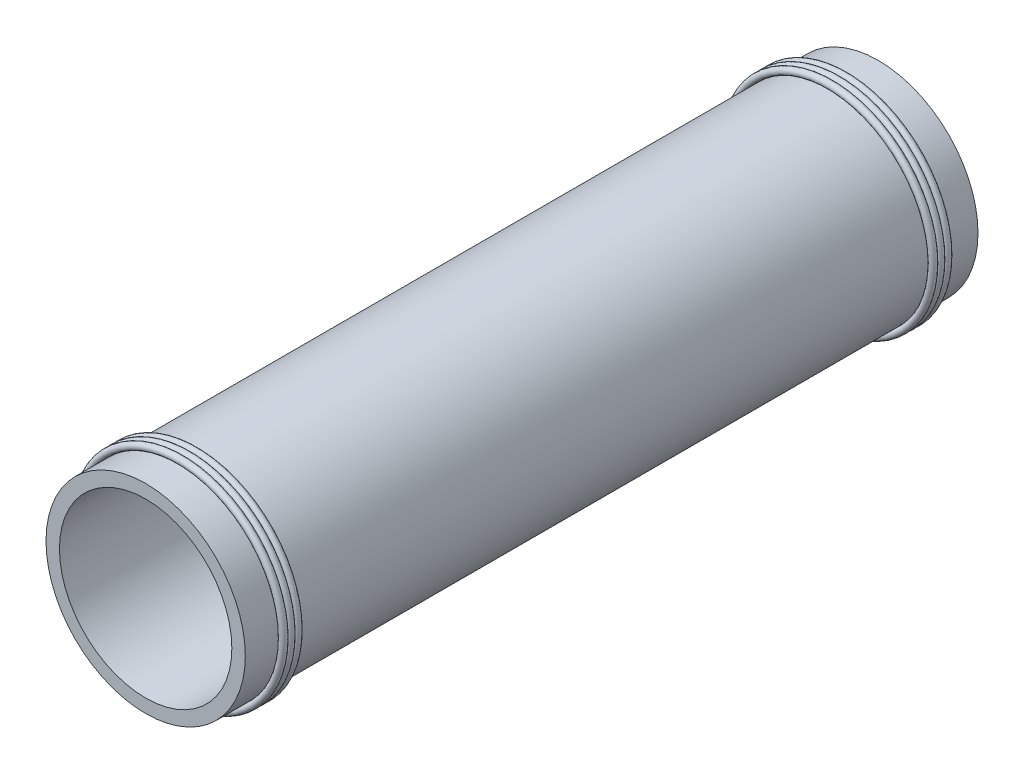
ISO-10303-21;
HEADER;
FILE_DESCRIPTION(('STEP AP214'),'2;1');
FILE_NAME('part.step','',(''),(''),'','','');
FILE_SCHEMA(('AUTOMOTIVE_DESIGN { 1 0 10303 214 1 1 1 1 }'));
ENDSEC;
DATA;
#1=APPLICATION_CONTEXT('core data for automotive mechanical design processes');
#2=APPLICATION_PROTOCOL_DEFINITION('international standard','automotive_design',2000,#1);
#3=PRODUCT_CONTEXT('',#1,'mechanical');
#4=PRODUCT('Part','Part','',(#3));
#5=PRODUCT_RELATED_PRODUCT_CATEGORY('part','',(#4));
#6=PRODUCT_DEFINITION_FORMATION('','',#4);
#7=PRODUCT_DEFINITION_CONTEXT('part definition',#1,'design');
#8=PRODUCT_DEFINITION('design','',#6,#7);
#9=PRODUCT_DEFINITION_SHAPE('','',#8);
#10=(LENGTH_UNIT() NAMED_UNIT(*) SI_UNIT(.MILLI.,.METRE.));
#11=(NAMED_UNIT(*) PLANE_ANGLE_UNIT() SI_UNIT($,.RADIAN.));
#12=(NAMED_UNIT(*) SI_UNIT($,.STERADIAN.) SOLID_ANGLE_UNIT());
#13=UNCERTAINTY_MEASURE_WITH_UNIT(LENGTH_MEASURE(1.E-05),#10,'distance_accuracy_value','');
#14=(GEOMETRIC_REPRESENTATION_CONTEXT(3) GLOBAL_UNCERTAINTY_ASSIGNED_CONTEXT((#13)) GLOBAL_UNIT_ASSIGNED_CONTEXT((#10,
#11,#12)) REPRESENTATION_CONTEXT('',''));
#15=CARTESIAN_POINT('',(0.,0.,0.));
#16=DIRECTION('',(0.,0.,1.));
#17=DIRECTION('',(1.,0.,0.));
#18=AXIS2_PLACEMENT_3D('',#15,#16,#17);
#19=CARTESIAN_POINT('',(0.,0.,-48.895));
#20=DIRECTION('',(0.,0.,-1.));
#21=DIRECTION('',(-1.,0.,0.));
#22=AXIS2_PLACEMENT_3D('',#19,#20,#21);
#23=TOROIDAL_SURFACE('',#22,15.19301,0.511810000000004);
#24=CARTESIAN_POINT('',(-15.70482,0.,-48.895));
#25=VERTEX_POINT('',#24);
#26=VERTEX_LOOP('',#25);
#27=FACE_BOUND('',#26,.T.);
#28=ADVANCED_FACE('F34',(#27),#23,.T.);
#29=CLOSED_SHELL('',(#28));
#30=MANIFOLD_SOLID_BREP('B2',#29);
#31=CARTESIAN_POINT('',(0.,0.,-47.8619153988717));
#32=DIRECTION('',(0.,0.,-1.));
#33=DIRECTION('',(-1.,0.,0.));
#34=AXIS2_PLACEMENT_3D('',#31,#32,#33);
#35=TOROIDAL_SURFACE('',#34,15.19301,0.511810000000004);
#36=CARTESIAN_POINT('',(-15.70482,0.,-47.8619153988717));
#37=VERTEX_POINT('',#36);
#38=VERTEX_LOOP('',#37);
#39=FACE_BOUND('',#38,.T.);
#40=ADVANCED_FACE('F53',(#39),#35,.T.);
#41=CLOSED_SHELL('',(#40));
#42=MANIFOLD_SOLID_BREP('B6',#41);
#43=CARTESIAN_POINT('',(0.,0.,-46.8251224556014));
#44=DIRECTION('',(0.,0.,-1.));
#45=DIRECTION('',(-1.,0.,0.));
#46=AXIS2_PLACEMENT_3D('',#43,#44,#45);
#47=TOROIDAL_SURFACE('',#46,15.19301,0.511810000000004);
#48=CARTESIAN_POINT('',(-15.70482,0.,-46.8251224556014));
#49=VERTEX_POINT('',#48);
#50=VERTEX_LOOP('',#49);
#51=FACE_BOUND('',#50,.T.);
#52=ADVANCED_FACE('F72',(#51),#47,.T.);
#53=CLOSED_SHELL('',(#52));
#54=MANIFOLD_SOLID_BREP('B30',#53);
#55=CARTESIAN_POINT('',(0.,0.,46.8251224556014));
#56=DIRECTION('',(0.,0.,-1.));
#57=DIRECTION('',(-1.,0.,0.));
#58=AXIS2_PLACEMENT_3D('',#55,#56,#57);
#59=TOROIDAL_SURFACE('',#58,15.19301,0.511810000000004);
#60=CARTESIAN_POINT('',(-15.70482,0.,46.8251224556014));
#61=VERTEX_POINT('',#60);
#62=VERTEX_LOOP('',#61);
#63=FACE_BOUND('',#62,.T.);
#64=ADVANCED_FACE('F91',(#63),#59,.T.);
#65=CLOSED_SHELL('',(#64));
#66=MANIFOLD_SOLID_BREP('B49',#65);
#67=CARTESIAN_POINT('',(0.,0.,47.8619153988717));
#68=DIRECTION('',(0.,0.,-1.));
#69=DIRECTION('',(-1.,0.,0.));
#70=AXIS2_PLACEMENT_3D('',#67,#68,#69);
#71=TOROIDAL_SURFACE('',#70,15.19301,0.511810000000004);
#72=CARTESIAN_POINT('',(-15.70482,0.,47.8619153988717));
#73=VERTEX_POINT('',#72);
#74=VERTEX_LOOP('',#73);
#75=FACE_BOUND('',#74,.T.);
#76=ADVANCED_FACE('F110',(#75),#71,.T.);
#77=CLOSED_SHELL('',(#76));
#78=MANIFOLD_SOLID_BREP('B68',#77);
#79=CARTESIAN_POINT('',(0.,0.,48.895));
#80=DIRECTION('',(0.,0.,-1.));
#81=DIRECTION('',(-1.,0.,0.));
#82=AXIS2_PLACEMENT_3D('',#79,#80,#81);
#83=TOROIDAL_SURFACE('',#82,15.19301,0.511810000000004);
#84=CARTESIAN_POINT('',(-15.70482,0.,48.895));
#85=VERTEX_POINT('',#84);
#86=VERTEX_LOOP('',#85);
#87=FACE_BOUND('',#86,.T.);
#88=ADVANCED_FACE('F130',(#87),#83,.T.);
#89=CLOSED_SHELL('',(#88));
#90=MANIFOLD_SOLID_BREP('B87',#89);
#91=CARTESIAN_POINT('',(0.,0.,53.975));
#92=DIRECTION('',(0.,0.,1.));
#93=DIRECTION('',(1.,0.,0.));
#94=AXIS2_PLACEMENT_3D('',#91,#92,#93);
#95=PLANE('',#94);
#96=CARTESIAN_POINT('',(0.,0.,53.975));
#97=DIRECTION('',(0.,0.,1.));
#98=DIRECTION('',(1.,0.,0.));
#99=AXIS2_PLACEMENT_3D('',#96,#97,#98);
#100=CIRCLE('',#99,14.6812);
#101=CARTESIAN_POINT('',(14.6812,0.,53.975));
#102=VERTEX_POINT('',#101);
#103=EDGE_CURVE('E129',#102,#102,#100,.T.);
#104=ORIENTED_EDGE('',*,*,#103,.T.);
#105=EDGE_LOOP('',(#104));
#106=FACE_BOUND('',#105,.T.);
#107=CARTESIAN_POINT('',(0.,0.,53.975));
#108=DIRECTION('',(0.,0.,1.));
#109=DIRECTION('',(1.,0.,0.));
#110=AXIS2_PLACEMENT_3D('',#107,#108,#109);
#111=CIRCLE('',#110,12.7);
#112=CARTESIAN_POINT('',(12.7,0.,53.975));
#113=VERTEX_POINT('',#112);
#114=EDGE_CURVE('E154',#113,#113,#111,.T.);
#115=ORIENTED_EDGE('',*,*,#114,.F.);
#116=EDGE_LOOP('',(#115));
#117=FACE_BOUND('',#116,.T.);
#118=ADVANCED_FACE('F143',(#106,#117),#95,.T.);
#119=CARTESIAN_POINT('',(0.,0.,-53.975));
#120=DIRECTION('',(0.,0.,1.));
#121=DIRECTION('',(1.,0.,0.));
#122=AXIS2_PLACEMENT_3D('',#119,#120,#121);
#123=PLANE('',#122);
#124=CARTESIAN_POINT('',(0.,0.,-53.975));
#125=DIRECTION('',(0.,0.,1.));
#126=DIRECTION('',(1.,0.,0.));
#127=AXIS2_PLACEMENT_3D('',#124,#125,#126);
#128=CIRCLE('',#127,14.6812);
#129=CARTESIAN_POINT('',(14.6812,0.,-53.975));
#130=VERTEX_POINT('',#129);
#131=EDGE_CURVE('E150',#130,#130,#128,.T.);
#132=ORIENTED_EDGE('',*,*,#131,.F.);
#133=EDGE_LOOP('',(#132));
#134=FACE_BOUND('',#133,.T.);
#135=CARTESIAN_POINT('',(0.,0.,-53.975));
#136=DIRECTION('',(0.,0.,1.));
#137=DIRECTION('',(1.,0.,0.));
#138=AXIS2_PLACEMENT_3D('',#135,#136,#137);
#139=CIRCLE('',#138,12.7);
#140=CARTESIAN_POINT('',(12.7,0.,-53.975));
#141=VERTEX_POINT('',#140);
#142=EDGE_CURVE('E158',#141,#141,#139,.T.);
#143=ORIENTED_EDGE('',*,*,#142,.T.);
#144=EDGE_LOOP('',(#143));
#145=FACE_BOUND('',#144,.T.);
#146=ADVANCED_FACE('F164',(#134,#145),#123,.F.);
#147=CARTESIAN_POINT('',(0.,0.,53.975));
#148=DIRECTION('',(0.,0.,-1.));
#149=DIRECTION('',(-1.,0.,0.));
#150=AXIS2_PLACEMENT_3D('',#147,#148,#149);
#151=CYLINDRICAL_SURFACE('',#150,14.6812);
#152=ORIENTED_EDGE('',*,*,#103,.F.);
#153=EDGE_LOOP('',(#152));
#154=FACE_BOUND('',#153,.T.);
#155=ORIENTED_EDGE('',*,*,#131,.T.);
#156=EDGE_LOOP('',(#155));
#157=FACE_BOUND('',#156,.T.);
#158=ADVANCED_FACE('F145',(#154,#157),#151,.T.);
#159=CARTESIAN_POINT('',(0.,0.,53.975));
#160=DIRECTION('',(0.,0.,-1.));
#161=DIRECTION('',(-1.,0.,0.));
#162=AXIS2_PLACEMENT_3D('',#159,#160,#161);
#163=CYLINDRICAL_SURFACE('',#162,12.7);
#164=ORIENTED_EDGE('',*,*,#114,.T.);
#165=EDGE_LOOP('',(#164));
#166=FACE_BOUND('',#165,.T.);
#167=ORIENTED_EDGE('',*,*,#142,.F.);
#168=EDGE_LOOP('',(#167));
#169=FACE_BOUND('',#168,.T.);
#170=ADVANCED_FACE('F166',(#166,#169),#163,.F.);
#171=CLOSED_SHELL('',(#118,#146,#158,#170));
#172=MANIFOLD_SOLID_BREP('B106',#171);
#173=ADVANCED_BREP_SHAPE_REPRESENTATION('',(#18,#30,#42,#54,#66,#78,#90,#172),#14);
#174=SHAPE_DEFINITION_REPRESENTATION(#9,#173);
ENDSEC;
END-ISO-10303-21;
